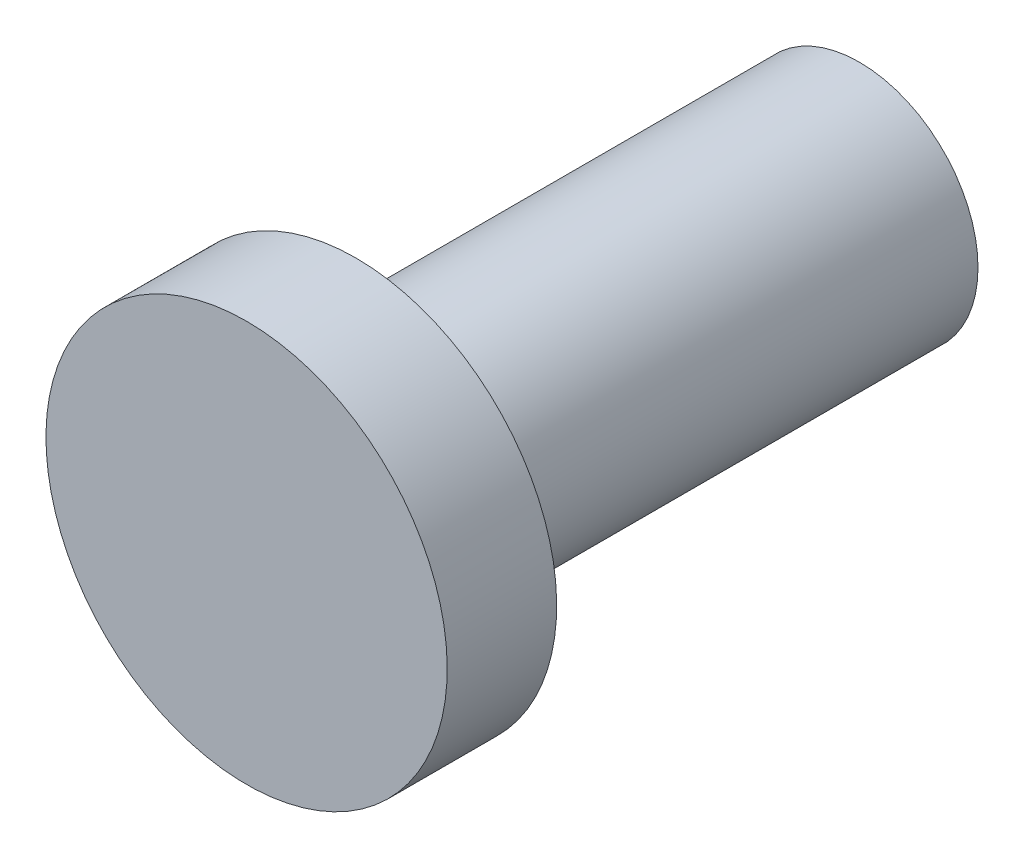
ISO-10303-21;
HEADER;
FILE_DESCRIPTION(('STEP AP214'),'2;1');
FILE_NAME('part.step','',(''),(''),'','','');
FILE_SCHEMA(('AUTOMOTIVE_DESIGN { 1 0 10303 214 1 1 1 1 }'));
ENDSEC;
DATA;
#1=APPLICATION_CONTEXT('core data for automotive mechanical design processes');
#2=APPLICATION_PROTOCOL_DEFINITION('international standard','automotive_design',2000,#1);
#3=PRODUCT_CONTEXT('',#1,'mechanical');
#4=PRODUCT('Part','Part','',(#3));
#5=PRODUCT_RELATED_PRODUCT_CATEGORY('part','',(#4));
#6=PRODUCT_DEFINITION_FORMATION('','',#4);
#7=PRODUCT_DEFINITION_CONTEXT('part definition',#1,'design');
#8=PRODUCT_DEFINITION('design','',#6,#7);
#9=PRODUCT_DEFINITION_SHAPE('','',#8);
#10=(LENGTH_UNIT() NAMED_UNIT(*) SI_UNIT(.MILLI.,.METRE.));
#11=(NAMED_UNIT(*) PLANE_ANGLE_UNIT() SI_UNIT($,.RADIAN.));
#12=(NAMED_UNIT(*) SI_UNIT($,.STERADIAN.) SOLID_ANGLE_UNIT());
#13=UNCERTAINTY_MEASURE_WITH_UNIT(LENGTH_MEASURE(1.E-05),#10,'distance_accuracy_value','');
#14=(GEOMETRIC_REPRESENTATION_CONTEXT(3) GLOBAL_UNCERTAINTY_ASSIGNED_CONTEXT((#13)) GLOBAL_UNIT_ASSIGNED_CONTEXT((#10,
#11,#12)) REPRESENTATION_CONTEXT('',''));
#15=CARTESIAN_POINT('',(0.,0.,0.));
#16=DIRECTION('',(0.,0.,1.));
#17=DIRECTION('',(1.,0.,0.));
#18=AXIS2_PLACEMENT_3D('',#15,#16,#17);
#19=CARTESIAN_POINT('',(0.,0.,-27.6));
#20=DIRECTION('',(0.,0.,-1.));
#21=DIRECTION('',(0.,1.,0.));
#22=AXIS2_PLACEMENT_3D('',#19,#20,#21);
#23=PLANE('',#22);
#24=CARTESIAN_POINT('',(0.,0.,-27.6));
#25=DIRECTION('',(0.,0.,-1.));
#26=DIRECTION('',(0.,1.,0.));
#27=AXIS2_PLACEMENT_3D('',#24,#25,#26);
#28=CIRCLE('',#27,6.5);
#29=CARTESIAN_POINT('',(0.,6.5,-27.6));
#30=VERTEX_POINT('',#29);
#31=EDGE_CURVE('E8',#30,#30,#28,.T.);
#32=ORIENTED_EDGE('',*,*,#31,.T.);
#33=EDGE_LOOP('',(#32));
#34=FACE_BOUND('',#33,.T.);
#35=ADVANCED_FACE('F12',(#34),#23,.T.);
#36=CARTESIAN_POINT('',(0.,0.,-37.6));
#37=DIRECTION('',(0.,0.,-1.));
#38=DIRECTION('',(0.,1.,0.));
#39=AXIS2_PLACEMENT_3D('',#36,#37,#38);
#40=CYLINDRICAL_SURFACE('',#39,6.5);
#41=CARTESIAN_POINT('',(0.,0.,0.));
#42=DIRECTION('',(0.,0.,-1.));
#43=DIRECTION('',(0.,1.,0.));
#44=AXIS2_PLACEMENT_3D('',#41,#42,#43);
#45=CIRCLE('',#44,6.5);
#46=CARTESIAN_POINT('',(0.,6.5,0.));
#47=VERTEX_POINT('',#46);
#48=EDGE_CURVE('E18',#47,#47,#45,.T.);
#49=ORIENTED_EDGE('',*,*,#48,.T.);
#50=EDGE_LOOP('',(#49));
#51=FACE_BOUND('',#50,.T.);
#52=ORIENTED_EDGE('',*,*,#31,.F.);
#53=EDGE_LOOP('',(#52));
#54=FACE_BOUND('',#53,.T.);
#55=ADVANCED_FACE('F45',(#51,#54),#40,.T.);
#56=CARTESIAN_POINT('',(6.5,0.,0.));
#57=DIRECTION('',(0.,0.,-1.));
#58=DIRECTION('',(0.,1.,0.));
#59=AXIS2_PLACEMENT_3D('',#56,#57,#58);
#60=PLANE('',#59);
#61=CARTESIAN_POINT('',(0.,0.,0.));
#62=DIRECTION('',(0.,0.,-1.));
#63=DIRECTION('',(0.,1.,0.));
#64=AXIS2_PLACEMENT_3D('',#61,#62,#63);
#65=CIRCLE('',#64,11.);
#66=CARTESIAN_POINT('',(0.,11.,0.));
#67=VERTEX_POINT('',#66);
#68=EDGE_CURVE('E22',#67,#67,#65,.T.);
#69=ORIENTED_EDGE('',*,*,#68,.T.);
#70=EDGE_LOOP('',(#69));
#71=FACE_BOUND('',#70,.T.);
#72=ORIENTED_EDGE('',*,*,#48,.F.);
#73=EDGE_LOOP('',(#72));
#74=FACE_BOUND('',#73,.T.);
#75=ADVANCED_FACE('F42',(#71,#74),#60,.T.);
#76=CARTESIAN_POINT('',(0.,0.,-37.6));
#77=DIRECTION('',(0.,0.,-1.));
#78=DIRECTION('',(0.,1.,0.));
#79=AXIS2_PLACEMENT_3D('',#76,#77,#78);
#80=CYLINDRICAL_SURFACE('',#79,11.);
#81=CARTESIAN_POINT('',(0.,0.,6.));
#82=DIRECTION('',(0.,0.,-1.));
#83=DIRECTION('',(0.,1.,0.));
#84=AXIS2_PLACEMENT_3D('',#81,#82,#83);
#85=CIRCLE('',#84,11.);
#86=CARTESIAN_POINT('',(0.,11.,6.));
#87=VERTEX_POINT('',#86);
#88=EDGE_CURVE('E26',#87,#87,#85,.T.);
#89=ORIENTED_EDGE('',*,*,#88,.T.);
#90=EDGE_LOOP('',(#89));
#91=FACE_BOUND('',#90,.T.);
#92=ORIENTED_EDGE('',*,*,#68,.F.);
#93=EDGE_LOOP('',(#92));
#94=FACE_BOUND('',#93,.T.);
#95=ADVANCED_FACE('F32',(#91,#94),#80,.T.);
#96=CARTESIAN_POINT('',(11.,0.,6.));
#97=DIRECTION('',(0.,0.,1.));
#98=DIRECTION('',(0.,-1.,0.));
#99=AXIS2_PLACEMENT_3D('',#96,#97,#98);
#100=PLANE('',#99);
#101=ORIENTED_EDGE('',*,*,#88,.F.);
#102=EDGE_LOOP('',(#101));
#103=FACE_BOUND('',#102,.T.);
#104=ADVANCED_FACE('F35',(#103),#100,.T.);
#105=CLOSED_SHELL('',(#35,#55,#75,#95,#104));
#106=MANIFOLD_SOLID_BREP('B1',#105);
#107=ADVANCED_BREP_SHAPE_REPRESENTATION('',(#18,#106),#14);
#108=SHAPE_DEFINITION_REPRESENTATION(#9,#107);
ENDSEC;
END-ISO-10303-21;
